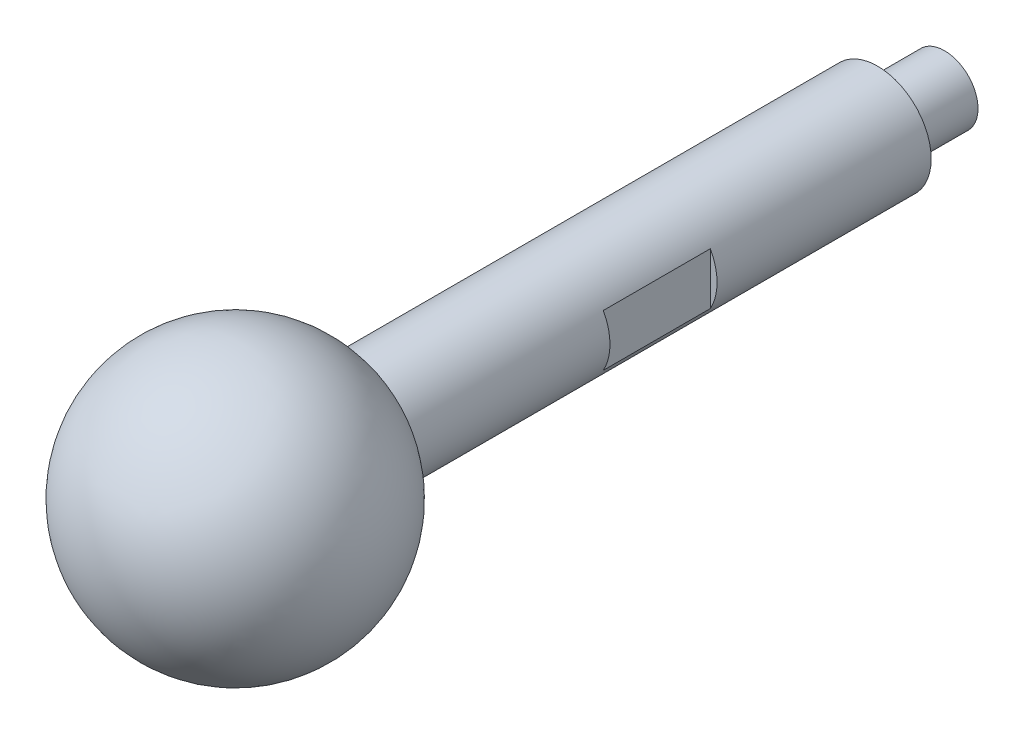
ISO-10303-21;
HEADER;
FILE_DESCRIPTION(('STEP AP214'),'2;1');
FILE_NAME('part.step','',(''),(''),'','','');
FILE_SCHEMA(('AUTOMOTIVE_DESIGN { 1 0 10303 214 1 1 1 1 }'));
ENDSEC;
DATA;
#1=APPLICATION_CONTEXT('core data for automotive mechanical design processes');
#2=APPLICATION_PROTOCOL_DEFINITION('international standard','automotive_design',2000,#1);
#3=PRODUCT_CONTEXT('',#1,'mechanical');
#4=PRODUCT('Part','Part','',(#3));
#5=PRODUCT_RELATED_PRODUCT_CATEGORY('part','',(#4));
#6=PRODUCT_DEFINITION_FORMATION('','',#4);
#7=PRODUCT_DEFINITION_CONTEXT('part definition',#1,'design');
#8=PRODUCT_DEFINITION('design','',#6,#7);
#9=PRODUCT_DEFINITION_SHAPE('','',#8);
#10=(LENGTH_UNIT() NAMED_UNIT(*) SI_UNIT(.MILLI.,.METRE.));
#11=(NAMED_UNIT(*) PLANE_ANGLE_UNIT() SI_UNIT($,.RADIAN.));
#12=(NAMED_UNIT(*) SI_UNIT($,.STERADIAN.) SOLID_ANGLE_UNIT());
#13=UNCERTAINTY_MEASURE_WITH_UNIT(LENGTH_MEASURE(1.E-05),#10,'distance_accuracy_value','');
#14=(GEOMETRIC_REPRESENTATION_CONTEXT(3) GLOBAL_UNCERTAINTY_ASSIGNED_CONTEXT((#13)) GLOBAL_UNIT_ASSIGNED_CONTEXT((#10,
#11,#12)) REPRESENTATION_CONTEXT('',''));
#15=CARTESIAN_POINT('',(0.,0.,0.));
#16=DIRECTION('',(0.,0.,1.));
#17=DIRECTION('',(1.,0.,0.));
#18=AXIS2_PLACEMENT_3D('',#15,#16,#17);
#19=CARTESIAN_POINT('',(0.,0.,0.));
#20=DIRECTION('',(0.,0.,-1.));
#21=DIRECTION('',(1.,0.,0.));
#22=AXIS2_PLACEMENT_3D('',#19,#20,#21);
#23=PLANE('',#22);
#24=CARTESIAN_POINT('',(0.,0.,0.));
#25=DIRECTION('',(0.,0.,-1.));
#26=DIRECTION('',(1.,0.,0.));
#27=AXIS2_PLACEMENT_3D('',#24,#25,#26);
#28=CIRCLE('',#27,4.);
#29=CARTESIAN_POINT('',(4.,0.,0.));
#30=VERTEX_POINT('',#29);
#31=EDGE_CURVE('E88',#30,#30,#28,.T.);
#32=ORIENTED_EDGE('',*,*,#31,.T.);
#33=EDGE_LOOP('',(#32));
#34=FACE_BOUND('',#33,.T.);
#35=CARTESIAN_POINT('',(0.,0.,0.));
#36=DIRECTION('',(0.,0.,-1.));
#37=DIRECTION('',(0.,-1.,0.));
#38=AXIS2_PLACEMENT_3D('',#35,#36,#37);
#39=CIRCLE('',#38,2.5);
#40=CARTESIAN_POINT('',(0.,-2.5,0.));
#41=VERTEX_POINT('',#40);
#42=EDGE_CURVE('E9',#41,#41,#39,.T.);
#43=ORIENTED_EDGE('',*,*,#42,.F.);
#44=EDGE_LOOP('',(#43));
#45=FACE_BOUND('',#44,.T.);
#46=ADVANCED_FACE('F14',(#34,#45),#23,.T.);
#47=CARTESIAN_POINT('',(-5.66262459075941,-1.98360347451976,40.));
#48=DIRECTION('',(0.,0.,1.));
#49=DIRECTION('',(-0.330600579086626,0.943770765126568,0.));
#50=AXIS2_PLACEMENT_3D('',#47,#48,#49);
#51=PLANE('',#50);
#52=CARTESIAN_POINT('',(0.,0.,40.));
#53=DIRECTION('',(0.,0.,-1.));
#54=DIRECTION('',(0.330600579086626,-0.943770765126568,0.));
#55=AXIS2_PLACEMENT_3D('',#52,#53,#54);
#56=CIRCLE('',#55,6.);
#57=CARTESIAN_POINT('',(1.98360347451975,-5.66262459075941,40.));
#58=VERTEX_POINT('',#57);
#59=EDGE_CURVE('E71',#58,#58,#56,.T.);
#60=ORIENTED_EDGE('',*,*,#59,.T.);
#61=EDGE_LOOP('',(#60));
#62=FACE_BOUND('',#61,.T.);
#63=CARTESIAN_POINT('',(0.,0.,40.));
#64=DIRECTION('',(0.,0.,-1.));
#65=DIRECTION('',(1.,0.,0.));
#66=AXIS2_PLACEMENT_3D('',#63,#64,#65);
#67=CIRCLE('',#66,4.);
#68=CARTESIAN_POINT('',(4.,0.,40.));
#69=VERTEX_POINT('',#68);
#70=EDGE_CURVE('E74',#69,#69,#67,.T.);
#71=ORIENTED_EDGE('',*,*,#70,.F.);
#72=EDGE_LOOP('',(#71));
#73=FACE_BOUND('',#72,.T.);
#74=ADVANCED_FACE('F139',(#62,#73),#51,.F.);
#75=CARTESIAN_POINT('',(0.,0.,48.));
#76=DIRECTION('',(0.,0.,-1.));
#77=DIRECTION('',(-0.943770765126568,-0.330600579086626,0.));
#78=AXIS2_PLACEMENT_3D('',#75,#76,#77);
#79=SPHERICAL_SURFACE('',#78,10.);
#80=ORIENTED_EDGE('',*,*,#59,.F.);
#81=EDGE_LOOP('',(#80));
#82=FACE_BOUND('',#81,.T.);
#83=ADVANCED_FACE('F145',(#82),#79,.T.);
#84=CARTESIAN_POINT('',(-3.5,-2.,24.));
#85=DIRECTION('',(0.,0.,-1.));
#86=DIRECTION('',(1.,0.,0.));
#87=AXIS2_PLACEMENT_3D('',#84,#85,#86);
#88=PLANE('',#87);
#89=DIRECTION('',(0.,-1.,0.));
#90=VECTOR('',#89,1.);
#91=CARTESIAN_POINT('',(-3.5,-2.,24.));
#92=LINE('',#91,#90);
#93=CARTESIAN_POINT('',(-3.5,1.93649167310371,24.));
#94=VERTEX_POINT('',#93);
#95=CARTESIAN_POINT('',(-3.5,-1.93649167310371,24.));
#96=VERTEX_POINT('',#95);
#97=EDGE_CURVE('E29',#94,#96,#92,.T.);
#98=ORIENTED_EDGE('',*,*,#97,.T.);
#99=CARTESIAN_POINT('',(0.,0.,24.));
#100=DIRECTION('',(0.,0.,-1.));
#101=DIRECTION('',(1.,0.,0.));
#102=AXIS2_PLACEMENT_3D('',#99,#100,#101);
#103=CIRCLE('',#102,4.);
#104=EDGE_CURVE('E65',#96,#94,#103,.T.);
#105=ORIENTED_EDGE('',*,*,#104,.T.);
#106=EDGE_LOOP('',(#98,#105));
#107=FACE_BOUND('',#106,.T.);
#108=ADVANCED_FACE('F100',(#107),#88,.T.);
#109=CARTESIAN_POINT('',(-3.5,-2.,16.));
#110=DIRECTION('',(0.,0.,1.));
#111=DIRECTION('',(-1.,0.,0.));
#112=AXIS2_PLACEMENT_3D('',#109,#110,#111);
#113=PLANE('',#112);
#114=CARTESIAN_POINT('',(0.,0.,16.));
#115=DIRECTION('',(0.,0.,1.));
#116=DIRECTION('',(-1.,0.,0.));
#117=AXIS2_PLACEMENT_3D('',#114,#115,#116);
#118=CIRCLE('',#117,4.);
#119=CARTESIAN_POINT('',(-3.5,1.93649167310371,16.));
#120=VERTEX_POINT('',#119);
#121=CARTESIAN_POINT('',(-3.5,-1.93649167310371,16.));
#122=VERTEX_POINT('',#121);
#123=EDGE_CURVE('E57',#120,#122,#118,.T.);
#124=ORIENTED_EDGE('',*,*,#123,.T.);
#125=DIRECTION('',(0.,1.,0.));
#126=VECTOR('',#125,1.);
#127=CARTESIAN_POINT('',(-3.5,-2.,16.));
#128=LINE('',#127,#126);
#129=EDGE_CURVE('E60',#122,#120,#128,.T.);
#130=ORIENTED_EDGE('',*,*,#129,.T.);
#131=EDGE_LOOP('',(#124,#130));
#132=FACE_BOUND('',#131,.T.);
#133=ADVANCED_FACE('F59',(#132),#113,.T.);
#134=CARTESIAN_POINT('',(-3.5,2.,16.));
#135=DIRECTION('',(-1.,0.,0.));
#136=DIRECTION('',(0.,0.,1.));
#137=AXIS2_PLACEMENT_3D('',#134,#135,#136);
#138=PLANE('',#137);
#139=DIRECTION('',(0.,0.,1.));
#140=VECTOR('',#139,1.);
#141=CARTESIAN_POINT('',(-3.5,-1.93649167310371,0.));
#142=LINE('',#141,#140);
#143=EDGE_CURVE('E68',#122,#96,#142,.T.);
#144=ORIENTED_EDGE('',*,*,#143,.T.);
#145=ORIENTED_EDGE('',*,*,#97,.F.);
#146=DIRECTION('',(0.,0.,1.));
#147=VECTOR('',#146,1.);
#148=CARTESIAN_POINT('',(-3.5,1.93649167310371,0.));
#149=LINE('',#148,#147);
#150=EDGE_CURVE('E64',#94,#120,#149,.F.);
#151=ORIENTED_EDGE('',*,*,#150,.T.);
#152=ORIENTED_EDGE('',*,*,#129,.F.);
#153=EDGE_LOOP('',(#144,#145,#151,#152));
#154=FACE_BOUND('',#153,.T.);
#155=ADVANCED_FACE('F67',(#154),#138,.T.);
#156=CARTESIAN_POINT('',(3.5,-2.,24.));
#157=DIRECTION('',(0.,0.,1.));
#158=DIRECTION('',(-1.,0.,0.));
#159=AXIS2_PLACEMENT_3D('',#156,#157,#158);
#160=PLANE('',#159);
#161=DIRECTION('',(0.,-1.,0.));
#162=VECTOR('',#161,1.);
#163=CARTESIAN_POINT('',(3.5,-2.,24.));
#164=LINE('',#163,#162);
#165=CARTESIAN_POINT('',(3.5,1.93649167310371,24.));
#166=VERTEX_POINT('',#165);
#167=CARTESIAN_POINT('',(3.5,-1.93649167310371,24.));
#168=VERTEX_POINT('',#167);
#169=EDGE_CURVE('E86',#166,#168,#164,.T.);
#170=ORIENTED_EDGE('',*,*,#169,.F.);
#171=CARTESIAN_POINT('',(0.,0.,24.));
#172=DIRECTION('',(0.,0.,1.));
#173=DIRECTION('',(-1.,0.,0.));
#174=AXIS2_PLACEMENT_3D('',#171,#172,#173);
#175=CIRCLE('',#174,4.);
#176=EDGE_CURVE('E36',#168,#166,#175,.T.);
#177=ORIENTED_EDGE('',*,*,#176,.F.);
#178=EDGE_LOOP('',(#170,#177));
#179=FACE_BOUND('',#178,.T.);
#180=ADVANCED_FACE('F114',(#179),#160,.F.);
#181=CARTESIAN_POINT('',(3.5,2.,16.));
#182=DIRECTION('',(1.,0.,0.));
#183=DIRECTION('',(0.,0.,1.));
#184=AXIS2_PLACEMENT_3D('',#181,#182,#183);
#185=PLANE('',#184);
#186=DIRECTION('',(0.,0.,1.));
#187=VECTOR('',#186,1.);
#188=CARTESIAN_POINT('',(3.5,1.93649167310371,0.));
#189=LINE('',#188,#187);
#190=CARTESIAN_POINT('',(3.5,1.93649167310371,16.));
#191=VERTEX_POINT('',#190);
#192=EDGE_CURVE('E94',#191,#166,#189,.T.);
#193=ORIENTED_EDGE('',*,*,#192,.T.);
#194=ORIENTED_EDGE('',*,*,#169,.T.);
#195=DIRECTION('',(0.,0.,1.));
#196=VECTOR('',#195,1.);
#197=CARTESIAN_POINT('',(3.5,-1.93649167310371,0.));
#198=LINE('',#197,#196);
#199=CARTESIAN_POINT('',(3.5,-1.93649167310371,16.));
#200=VERTEX_POINT('',#199);
#201=EDGE_CURVE('E96',#168,#200,#198,.F.);
#202=ORIENTED_EDGE('',*,*,#201,.T.);
#203=DIRECTION('',(0.,1.,0.));
#204=VECTOR('',#203,1.);
#205=CARTESIAN_POINT('',(3.5,-2.,16.));
#206=LINE('',#205,#204);
#207=EDGE_CURVE('E101',#200,#191,#206,.T.);
#208=ORIENTED_EDGE('',*,*,#207,.T.);
#209=EDGE_LOOP('',(#193,#194,#202,#208));
#210=FACE_BOUND('',#209,.T.);
#211=ADVANCED_FACE('F108',(#210),#185,.T.);
#212=CARTESIAN_POINT('',(3.5,-2.,16.));
#213=DIRECTION('',(0.,0.,-1.));
#214=DIRECTION('',(1.,0.,0.));
#215=AXIS2_PLACEMENT_3D('',#212,#213,#214);
#216=PLANE('',#215);
#217=CARTESIAN_POINT('',(0.,0.,16.));
#218=DIRECTION('',(0.,0.,-1.));
#219=DIRECTION('',(1.,0.,0.));
#220=AXIS2_PLACEMENT_3D('',#217,#218,#219);
#221=CIRCLE('',#220,4.);
#222=EDGE_CURVE('E92',#191,#200,#221,.T.);
#223=ORIENTED_EDGE('',*,*,#222,.F.);
#224=ORIENTED_EDGE('',*,*,#207,.F.);
#225=EDGE_LOOP('',(#223,#224));
#226=FACE_BOUND('',#225,.T.);
#227=ADVANCED_FACE('F111',(#226),#216,.F.);
#228=CARTESIAN_POINT('',(0.,0.,0.));
#229=DIRECTION('',(0.,0.,1.));
#230=DIRECTION('',(-1.,0.,0.));
#231=AXIS2_PLACEMENT_3D('',#228,#229,#230);
#232=CYLINDRICAL_SURFACE('',#231,4.);
#233=ORIENTED_EDGE('',*,*,#222,.T.);
#234=ORIENTED_EDGE('',*,*,#201,.F.);
#235=ORIENTED_EDGE('',*,*,#176,.T.);
#236=ORIENTED_EDGE('',*,*,#192,.F.);
#237=EDGE_LOOP('',(#233,#234,#235,#236));
#238=FACE_BOUND('',#237,.T.);
#239=ORIENTED_EDGE('',*,*,#70,.T.);
#240=EDGE_LOOP('',(#239));
#241=FACE_BOUND('',#240,.T.);
#242=ORIENTED_EDGE('',*,*,#31,.F.);
#243=EDGE_LOOP('',(#242));
#244=FACE_BOUND('',#243,.T.);
#245=ORIENTED_EDGE('',*,*,#143,.F.);
#246=ORIENTED_EDGE('',*,*,#123,.F.);
#247=ORIENTED_EDGE('',*,*,#150,.F.);
#248=ORIENTED_EDGE('',*,*,#104,.F.);
#249=EDGE_LOOP('',(#245,#246,#247,#248));
#250=FACE_BOUND('',#249,.T.);
#251=ADVANCED_FACE('F70',(#238,#241,#244,#250),#232,.T.);
#252=CARTESIAN_POINT('',(0.,0.,-5.));
#253=DIRECTION('',(0.,0.,1.));
#254=DIRECTION('',(0.,1.,0.));
#255=AXIS2_PLACEMENT_3D('',#252,#253,#254);
#256=PLANE('',#255);
#257=CARTESIAN_POINT('',(0.,0.,-5.));
#258=DIRECTION('',(0.,0.,1.));
#259=DIRECTION('',(0.,1.,0.));
#260=AXIS2_PLACEMENT_3D('',#257,#258,#259);
#261=CIRCLE('',#260,2.5);
#262=CARTESIAN_POINT('',(0.,2.5,-5.));
#263=VERTEX_POINT('',#262);
#264=EDGE_CURVE('E22',#263,#263,#261,.F.);
#265=ORIENTED_EDGE('',*,*,#264,.T.);
#266=EDGE_LOOP('',(#265));
#267=FACE_BOUND('',#266,.T.);
#268=ADVANCED_FACE('F16',(#267),#256,.F.);
#269=CARTESIAN_POINT('',(0.,0.,15.));
#270=DIRECTION('',(0.,0.,1.));
#271=DIRECTION('',(0.,1.,0.));
#272=AXIS2_PLACEMENT_3D('',#269,#270,#271);
#273=CYLINDRICAL_SURFACE('',#272,2.5);
#274=ORIENTED_EDGE('',*,*,#42,.T.);
#275=EDGE_LOOP('',(#274));
#276=FACE_BOUND('',#275,.T.);
#277=ORIENTED_EDGE('',*,*,#264,.F.);
#278=EDGE_LOOP('',(#277));
#279=FACE_BOUND('',#278,.T.);
#280=ADVANCED_FACE('F127',(#276,#279),#273,.T.);
#281=CLOSED_SHELL('',(#46,#74,#83,#108,#133,#155,#180,#211,#227,#251,#268,#280));
#282=MANIFOLD_SOLID_BREP('B1',#281);
#283=ADVANCED_BREP_SHAPE_REPRESENTATION('',(#18,#282),#14);
#284=SHAPE_DEFINITION_REPRESENTATION(#9,#283);
ENDSEC;
END-ISO-10303-21;
